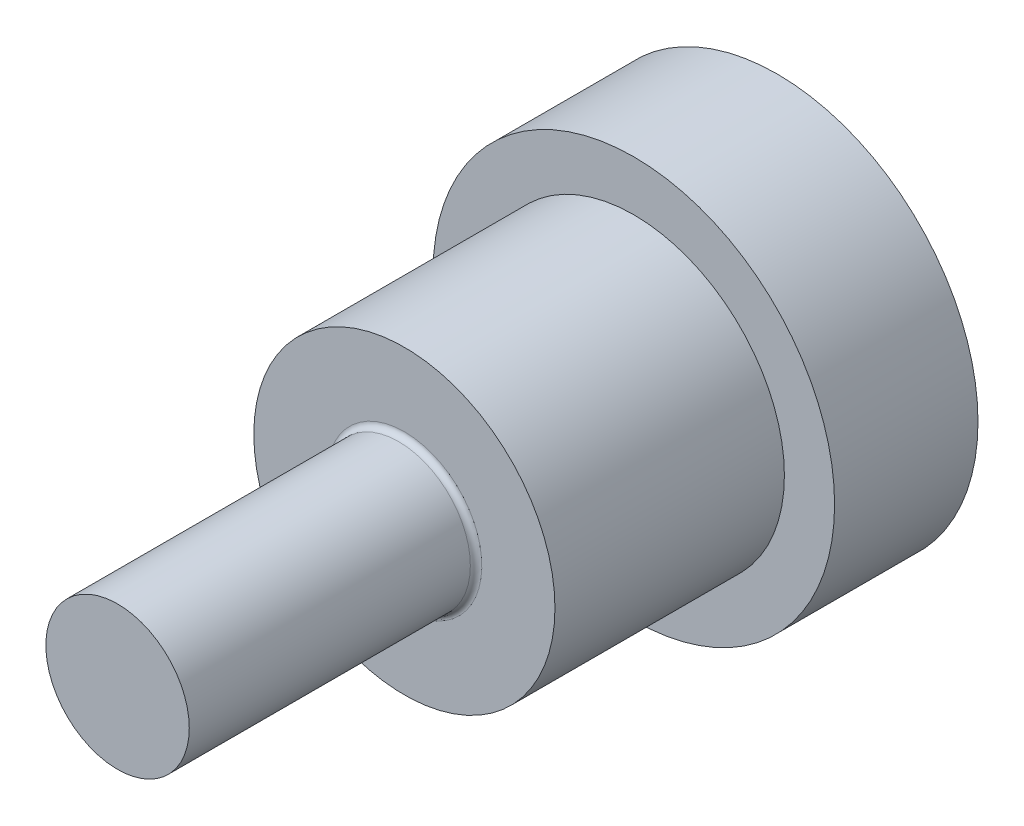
ISO-10303-21;
HEADER;
FILE_DESCRIPTION(('STEP AP214'),'2;1');
FILE_NAME('part.step','',(''),(''),'','','');
FILE_SCHEMA(('AUTOMOTIVE_DESIGN { 1 0 10303 214 1 1 1 1 }'));
ENDSEC;
DATA;
#1=APPLICATION_CONTEXT('core data for automotive mechanical design processes');
#2=APPLICATION_PROTOCOL_DEFINITION('international standard','automotive_design',2000,#1);
#3=PRODUCT_CONTEXT('',#1,'mechanical');
#4=PRODUCT('Part','Part','',(#3));
#5=PRODUCT_RELATED_PRODUCT_CATEGORY('part','',(#4));
#6=PRODUCT_DEFINITION_FORMATION('','',#4);
#7=PRODUCT_DEFINITION_CONTEXT('part definition',#1,'design');
#8=PRODUCT_DEFINITION('design','',#6,#7);
#9=PRODUCT_DEFINITION_SHAPE('','',#8);
#10=(LENGTH_UNIT() NAMED_UNIT(*) SI_UNIT(.MILLI.,.METRE.));
#11=(NAMED_UNIT(*) PLANE_ANGLE_UNIT() SI_UNIT($,.RADIAN.));
#12=(NAMED_UNIT(*) SI_UNIT($,.STERADIAN.) SOLID_ANGLE_UNIT());
#13=UNCERTAINTY_MEASURE_WITH_UNIT(LENGTH_MEASURE(1.E-05),#10,'distance_accuracy_value','');
#14=(GEOMETRIC_REPRESENTATION_CONTEXT(3) GLOBAL_UNCERTAINTY_ASSIGNED_CONTEXT((#13)) GLOBAL_UNIT_ASSIGNED_CONTEXT((#10,
#11,#12)) REPRESENTATION_CONTEXT('',''));
#15=CARTESIAN_POINT('',(0.,0.,0.));
#16=DIRECTION('',(0.,0.,1.));
#17=DIRECTION('',(1.,0.,0.));
#18=AXIS2_PLACEMENT_3D('',#15,#16,#17);
#19=CARTESIAN_POINT('',(0.,0.,-1.));
#20=DIRECTION('',(0.,0.,-1.));
#21=DIRECTION('',(0.,-1.,0.));
#22=AXIS2_PLACEMENT_3D('',#19,#20,#21);
#23=PLANE('',#22);
#24=CARTESIAN_POINT('',(0.,0.,-1.));
#25=DIRECTION('',(0.,0.,-1.));
#26=DIRECTION('',(0.,1.,0.));
#27=AXIS2_PLACEMENT_3D('',#24,#25,#26);
#28=CIRCLE('',#27,5.25);
#29=CARTESIAN_POINT('',(0.,5.25,-1.00000000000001));
#30=VERTEX_POINT('',#29);
#31=EDGE_CURVE('E9',#30,#30,#28,.F.);
#32=ORIENTED_EDGE('',*,*,#31,.F.);
#33=EDGE_LOOP('',(#32));
#34=FACE_BOUND('',#33,.T.);
#35=CARTESIAN_POINT('',(0.,0.,-1.));
#36=DIRECTION('',(0.,0.,-1.));
#37=DIRECTION('',(0.,1.,0.));
#38=AXIS2_PLACEMENT_3D('',#35,#36,#37);
#39=CIRCLE('',#38,7.);
#40=CARTESIAN_POINT('',(0.,7.,-1.00000000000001));
#41=VERTEX_POINT('',#40);
#42=EDGE_CURVE('E89',#41,#41,#39,.T.);
#43=ORIENTED_EDGE('',*,*,#42,.F.);
#44=EDGE_LOOP('',(#43));
#45=FACE_BOUND('',#44,.T.);
#46=ADVANCED_FACE('F14',(#34,#45),#23,.F.);
#47=CARTESIAN_POINT('',(0.,0.,-6.));
#48=DIRECTION('',(0.,0.,1.));
#49=DIRECTION('',(0.,1.,0.));
#50=AXIS2_PLACEMENT_3D('',#47,#48,#49);
#51=CYLINDRICAL_SURFACE('',#50,7.);
#52=CARTESIAN_POINT('',(0.,0.,-6.));
#53=DIRECTION('',(0.,0.,-1.));
#54=DIRECTION('',(0.,1.,0.));
#55=AXIS2_PLACEMENT_3D('',#52,#53,#54);
#56=CIRCLE('',#55,7.);
#57=CARTESIAN_POINT('',(0.,6.99999999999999,-6.00000000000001));
#58=VERTEX_POINT('',#57);
#59=EDGE_CURVE('E348',#58,#58,#56,.T.);
#60=ORIENTED_EDGE('',*,*,#59,.F.);
#61=EDGE_LOOP('',(#60));
#62=FACE_BOUND('',#61,.T.);
#63=ORIENTED_EDGE('',*,*,#42,.T.);
#64=EDGE_LOOP('',(#63));
#65=FACE_BOUND('',#64,.T.);
#66=ADVANCED_FACE('F148',(#62,#65),#51,.T.);
#67=CARTESIAN_POINT('',(0.,0.,-6.));
#68=DIRECTION('',(0.,0.,-1.));
#69=DIRECTION('',(0.,-1.,0.));
#70=AXIS2_PLACEMENT_3D('',#67,#68,#69);
#71=PLANE('',#70);
#72=ORIENTED_EDGE('',*,*,#59,.T.);
#73=EDGE_LOOP('',(#72));
#74=FACE_BOUND('',#73,.T.);
#75=CARTESIAN_POINT('',(0.,0.,-6.));
#76=DIRECTION('',(0.,0.,-1.));
#77=DIRECTION('',(0.,1.,0.));
#78=AXIS2_PLACEMENT_3D('',#75,#76,#77);
#79=CIRCLE('',#78,3.);
#80=CARTESIAN_POINT('',(0.,2.99999999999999,-6.00000000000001));
#81=VERTEX_POINT('',#80);
#82=EDGE_CURVE('E350',#81,#81,#79,.T.);
#83=ORIENTED_EDGE('',*,*,#82,.F.);
#84=EDGE_LOOP('',(#83));
#85=FACE_BOUND('',#84,.T.);
#86=ADVANCED_FACE('F154',(#74,#85),#71,.T.);
#87=CARTESIAN_POINT('',(0.,0.,17.));
#88=DIRECTION('',(0.,0.,1.));
#89=DIRECTION('',(0.,-1.,0.));
#90=AXIS2_PLACEMENT_3D('',#87,#88,#89);
#91=CYLINDRICAL_SURFACE('',#90,5.25);
#92=ORIENTED_EDGE('',*,*,#31,.T.);
#93=EDGE_LOOP('',(#92));
#94=FACE_BOUND('',#93,.T.);
#95=CARTESIAN_POINT('',(0.,0.,7.));
#96=DIRECTION('',(0.,0.,1.));
#97=DIRECTION('',(1.,0.,0.));
#98=AXIS2_PLACEMENT_3D('',#95,#96,#97);
#99=CIRCLE('',#98,5.25);
#100=CARTESIAN_POINT('',(5.25,0.,7.));
#101=VERTEX_POINT('',#100);
#102=EDGE_CURVE('E351',#101,#101,#99,.T.);
#103=ORIENTED_EDGE('',*,*,#102,.F.);
#104=EDGE_LOOP('',(#103));
#105=FACE_BOUND('',#104,.T.);
#106=ADVANCED_FACE('F160',(#94,#105),#91,.T.);
#107=CARTESIAN_POINT('',(0.,0.,17.));
#108=DIRECTION('',(0.,0.,-1.));
#109=DIRECTION('',(0.,1.,0.));
#110=AXIS2_PLACEMENT_3D('',#107,#108,#109);
#111=PLANE('',#110);
#112=CARTESIAN_POINT('',(0.,0.,17.));
#113=DIRECTION('',(0.,0.,1.));
#114=DIRECTION('',(1.,0.,0.));
#115=AXIS2_PLACEMENT_3D('',#112,#113,#114);
#116=CIRCLE('',#115,2.5);
#117=CARTESIAN_POINT('',(2.5,0.,17.));
#118=VERTEX_POINT('',#117);
#119=EDGE_CURVE('E86',#118,#118,#116,.T.);
#120=ORIENTED_EDGE('',*,*,#119,.T.);
#121=EDGE_LOOP('',(#120));
#122=FACE_BOUND('',#121,.T.);
#123=ADVANCED_FACE('F163',(#122),#111,.F.);
#124=CARTESIAN_POINT('',(0.,0.,17.));
#125=DIRECTION('',(0.,0.,1.));
#126=DIRECTION('',(0.,-1.,0.));
#127=AXIS2_PLACEMENT_3D('',#124,#125,#126);
#128=CYLINDRICAL_SURFACE('',#127,2.5);
#129=CARTESIAN_POINT('',(0.,0.,7.2));
#130=DIRECTION('',(0.,0.,-1.));
#131=DIRECTION('',(0.,1.,0.));
#132=AXIS2_PLACEMENT_3D('',#129,#130,#131);
#133=CIRCLE('',#132,2.5);
#134=CARTESIAN_POINT('',(0.,2.5,7.2));
#135=VERTEX_POINT('',#134);
#136=EDGE_CURVE('E118',#135,#135,#133,.F.);
#137=ORIENTED_EDGE('',*,*,#136,.T.);
#138=EDGE_LOOP('',(#137));
#139=FACE_BOUND('',#138,.T.);
#140=ORIENTED_EDGE('',*,*,#119,.F.);
#141=EDGE_LOOP('',(#140));
#142=FACE_BOUND('',#141,.T.);
#143=ADVANCED_FACE('F170',(#139,#142),#128,.T.);
#144=CARTESIAN_POINT('',(0.,0.,7.2));
#145=DIRECTION('',(0.,0.,-1.));
#146=DIRECTION('',(0.,1.,0.));
#147=AXIS2_PLACEMENT_3D('',#144,#145,#146);
#148=TOROIDAL_SURFACE('',#147,2.7,0.2);
#149=CARTESIAN_POINT('',(0.,0.,7.));
#150=DIRECTION('',(0.,0.,-1.));
#151=DIRECTION('',(0.,1.,0.));
#152=AXIS2_PLACEMENT_3D('',#149,#150,#151);
#153=CIRCLE('',#152,2.7);
#154=CARTESIAN_POINT('',(0.,2.7,7.));
#155=VERTEX_POINT('',#154);
#156=EDGE_CURVE('E122',#155,#155,#153,.T.);
#157=ORIENTED_EDGE('',*,*,#156,.F.);
#158=EDGE_LOOP('',(#157));
#159=FACE_BOUND('',#158,.T.);
#160=ORIENTED_EDGE('',*,*,#136,.F.);
#161=EDGE_LOOP('',(#160));
#162=FACE_BOUND('',#161,.T.);
#163=ADVANCED_FACE('F16',(#159,#162),#148,.F.);
#164=CARTESIAN_POINT('',(2.5,0.,7.));
#165=DIRECTION('',(0.,0.,-1.));
#166=DIRECTION('',(0.,1.,0.));
#167=AXIS2_PLACEMENT_3D('',#164,#165,#166);
#168=PLANE('',#167);
#169=ORIENTED_EDGE('',*,*,#156,.T.);
#170=EDGE_LOOP('',(#169));
#171=FACE_BOUND('',#170,.T.);
#172=ORIENTED_EDGE('',*,*,#102,.T.);
#173=EDGE_LOOP('',(#172));
#174=FACE_BOUND('',#173,.T.);
#175=ADVANCED_FACE('F165',(#171,#174),#168,.F.);
#176=CARTESIAN_POINT('',(1.25,-0.721687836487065,-3.5));
#177=DIRECTION('',(0.,0.,-1.));
#178=DIRECTION('',(1.,0.,0.));
#179=AXIS2_PLACEMENT_3D('',#176,#177,#178);
#180=PLANE('',#179);
#181=DIRECTION('',(0.866025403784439,0.5,0.));
#182=VECTOR('',#181,1.);
#183=CARTESIAN_POINT('',(0.,-1.44337567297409,-3.5));
#184=LINE('',#183,#182);
#185=CARTESIAN_POINT('',(0.,-1.44337567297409,-3.5));
#186=VERTEX_POINT('',#185);
#187=CARTESIAN_POINT('',(1.25,-0.721687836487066,-3.5));
#188=VERTEX_POINT('',#187);
#189=EDGE_CURVE('E66',#186,#188,#184,.T.);
#190=ORIENTED_EDGE('',*,*,#189,.F.);
#191=DIRECTION('',(-0.86602540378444,0.5,0.));
#192=VECTOR('',#191,1.);
#193=CARTESIAN_POINT('',(0.,-1.44337567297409,-3.5));
#194=LINE('',#193,#192);
#195=CARTESIAN_POINT('',(-1.25,-0.721687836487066,-3.5));
#196=VERTEX_POINT('',#195);
#197=EDGE_CURVE('E93',#186,#196,#194,.T.);
#198=ORIENTED_EDGE('',*,*,#197,.T.);
#199=DIRECTION('',(0.,1.,0.));
#200=VECTOR('',#199,1.);
#201=CARTESIAN_POINT('',(-1.25,-0.721687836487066,-3.5));
#202=LINE('',#201,#200);
#203=CARTESIAN_POINT('',(-1.25,0.721687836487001,-3.5));
#204=VERTEX_POINT('',#203);
#205=EDGE_CURVE('E96',#196,#204,#202,.T.);
#206=ORIENTED_EDGE('',*,*,#205,.T.);
#207=DIRECTION('',(-0.86602540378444,-0.5,0.));
#208=VECTOR('',#207,1.);
#209=CARTESIAN_POINT('',(0.,1.44337567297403,-3.5));
#210=LINE('',#209,#208);
#211=CARTESIAN_POINT('',(0.,1.44337567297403,-3.5));
#212=VERTEX_POINT('',#211);
#213=EDGE_CURVE('E99',#212,#204,#210,.T.);
#214=ORIENTED_EDGE('',*,*,#213,.F.);
#215=DIRECTION('',(0.86602540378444,-0.5,0.));
#216=VECTOR('',#215,1.);
#217=CARTESIAN_POINT('',(0.,1.44337567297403,-3.5));
#218=LINE('',#217,#216);
#219=CARTESIAN_POINT('',(1.25,0.721687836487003,-3.5));
#220=VERTEX_POINT('',#219);
#221=EDGE_CURVE('E102',#212,#220,#218,.T.);
#222=ORIENTED_EDGE('',*,*,#221,.T.);
#223=DIRECTION('',(0.,-1.,0.));
#224=VECTOR('',#223,1.);
#225=CARTESIAN_POINT('',(1.25,0.721687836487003,-3.5));
#226=LINE('',#225,#224);
#227=EDGE_CURVE('E105',#220,#188,#226,.T.);
#228=ORIENTED_EDGE('',*,*,#227,.T.);
#229=EDGE_LOOP('',(#190,#198,#206,#214,#222,#228));
#230=FACE_BOUND('',#229,.T.);
#231=ADVANCED_FACE('F168',(#230),#180,.T.);
#232=CARTESIAN_POINT('',(-1.25,-0.721687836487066,-3.5));
#233=DIRECTION('',(-1.,0.,0.));
#234=DIRECTION('',(0.,1.,0.));
#235=AXIS2_PLACEMENT_3D('',#232,#233,#234);
#236=PLANE('',#235);
#237=DIRECTION('',(0.,0.,-1.));
#238=VECTOR('',#237,1.);
#239=CARTESIAN_POINT('',(-1.25,-0.721687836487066,-3.5));
#240=LINE('',#239,#238);
#241=CARTESIAN_POINT('',(-1.25,-0.721687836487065,-5.));
#242=VERTEX_POINT('',#241);
#243=EDGE_CURVE('E109',#196,#242,#240,.T.);
#244=ORIENTED_EDGE('',*,*,#243,.T.);
#245=DIRECTION('',(0.,1.,0.));
#246=VECTOR('',#245,1.);
#247=CARTESIAN_POINT('',(-1.25,-0.721687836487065,-5.));
#248=LINE('',#247,#246);
#249=CARTESIAN_POINT('',(-1.25,0.721687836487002,-5.));
#250=VERTEX_POINT('',#249);
#251=EDGE_CURVE('E360',#242,#250,#248,.T.);
#252=ORIENTED_EDGE('',*,*,#251,.T.);
#253=DIRECTION('',(0.,0.,-1.));
#254=VECTOR('',#253,1.);
#255=CARTESIAN_POINT('',(-1.25,0.721687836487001,-3.5));
#256=LINE('',#255,#254);
#257=EDGE_CURVE('E111',#204,#250,#256,.T.);
#258=ORIENTED_EDGE('',*,*,#257,.F.);
#259=ORIENTED_EDGE('',*,*,#205,.F.);
#260=EDGE_LOOP('',(#244,#252,#258,#259));
#261=FACE_BOUND('',#260,.T.);
#262=ADVANCED_FACE('F208',(#261),#236,.F.);
#263=CARTESIAN_POINT('',(0.,1.44337567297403,-3.5));
#264=DIRECTION('',(0.5,-0.86602540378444,0.));
#265=DIRECTION('',(-0.86602540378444,-0.5,0.));
#266=AXIS2_PLACEMENT_3D('',#263,#264,#265);
#267=PLANE('',#266);
#268=ORIENTED_EDGE('',*,*,#257,.T.);
#269=DIRECTION('',(-0.86602540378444,-0.5,0.));
#270=VECTOR('',#269,1.);
#271=CARTESIAN_POINT('',(0.,1.44337567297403,-5.));
#272=LINE('',#271,#270);
#273=CARTESIAN_POINT('',(0.,1.44337567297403,-5.));
#274=VERTEX_POINT('',#273);
#275=EDGE_CURVE('E363',#274,#250,#272,.T.);
#276=ORIENTED_EDGE('',*,*,#275,.F.);
#277=DIRECTION('',(0.,0.,-1.));
#278=VECTOR('',#277,1.);
#279=CARTESIAN_POINT('',(0.,1.44337567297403,-3.5));
#280=LINE('',#279,#278);
#281=EDGE_CURVE('E113',#212,#274,#280,.T.);
#282=ORIENTED_EDGE('',*,*,#281,.F.);
#283=ORIENTED_EDGE('',*,*,#213,.T.);
#284=EDGE_LOOP('',(#268,#276,#282,#283));
#285=FACE_BOUND('',#284,.T.);
#286=ADVANCED_FACE('F217',(#285),#267,.T.);
#287=CARTESIAN_POINT('',(0.,1.44337567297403,-3.5));
#288=DIRECTION('',(0.5,0.86602540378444,0.));
#289=DIRECTION('',(0.86602540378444,-0.5,0.));
#290=AXIS2_PLACEMENT_3D('',#287,#288,#289);
#291=PLANE('',#290);
#292=ORIENTED_EDGE('',*,*,#281,.T.);
#293=DIRECTION('',(0.86602540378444,-0.5,0.));
#294=VECTOR('',#293,1.);
#295=CARTESIAN_POINT('',(0.,1.44337567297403,-5.));
#296=LINE('',#295,#294);
#297=CARTESIAN_POINT('',(1.25,0.721687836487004,-5.));
#298=VERTEX_POINT('',#297);
#299=EDGE_CURVE('E79',#274,#298,#296,.T.);
#300=ORIENTED_EDGE('',*,*,#299,.T.);
#301=DIRECTION('',(0.,0.,-1.));
#302=VECTOR('',#301,1.);
#303=CARTESIAN_POINT('',(1.25,0.721687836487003,-3.5));
#304=LINE('',#303,#302);
#305=EDGE_CURVE('E71',#220,#298,#304,.T.);
#306=ORIENTED_EDGE('',*,*,#305,.F.);
#307=ORIENTED_EDGE('',*,*,#221,.F.);
#308=EDGE_LOOP('',(#292,#300,#306,#307));
#309=FACE_BOUND('',#308,.T.);
#310=ADVANCED_FACE('F226',(#309),#291,.F.);
#311=CARTESIAN_POINT('',(1.25,0.721687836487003,-3.5));
#312=DIRECTION('',(1.,0.,0.));
#313=DIRECTION('',(0.,-1.,0.));
#314=AXIS2_PLACEMENT_3D('',#311,#312,#313);
#315=PLANE('',#314);
#316=ORIENTED_EDGE('',*,*,#305,.T.);
#317=DIRECTION('',(0.,-1.,0.));
#318=VECTOR('',#317,1.);
#319=CARTESIAN_POINT('',(1.25,0.721687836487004,-5.));
#320=LINE('',#319,#318);
#321=CARTESIAN_POINT('',(1.25,-0.721687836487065,-5.));
#322=VERTEX_POINT('',#321);
#323=EDGE_CURVE('E74',#298,#322,#320,.T.);
#324=ORIENTED_EDGE('',*,*,#323,.T.);
#325=DIRECTION('',(0.,0.,-1.));
#326=VECTOR('',#325,1.);
#327=CARTESIAN_POINT('',(1.25,-0.721687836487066,-3.5));
#328=LINE('',#327,#326);
#329=EDGE_CURVE('E63',#188,#322,#328,.T.);
#330=ORIENTED_EDGE('',*,*,#329,.F.);
#331=ORIENTED_EDGE('',*,*,#227,.F.);
#332=EDGE_LOOP('',(#316,#324,#330,#331));
#333=FACE_BOUND('',#332,.T.);
#334=ADVANCED_FACE('F75',(#333),#315,.F.);
#335=CARTESIAN_POINT('',(0.,-1.44337567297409,-3.5));
#336=DIRECTION('',(-0.5,0.86602540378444,0.));
#337=DIRECTION('',(0.86602540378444,0.5,0.));
#338=AXIS2_PLACEMENT_3D('',#335,#336,#337);
#339=PLANE('',#338);
#340=ORIENTED_EDGE('',*,*,#329,.T.);
#341=DIRECTION('',(0.866025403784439,0.5,0.));
#342=VECTOR('',#341,1.);
#343=CARTESIAN_POINT('',(0.,-1.44337567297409,-5.));
#344=LINE('',#343,#342);
#345=CARTESIAN_POINT('',(0.,-1.44337567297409,-5.));
#346=VERTEX_POINT('',#345);
#347=EDGE_CURVE('E29',#346,#322,#344,.T.);
#348=ORIENTED_EDGE('',*,*,#347,.F.);
#349=DIRECTION('',(0.,0.,-1.));
#350=VECTOR('',#349,1.);
#351=CARTESIAN_POINT('',(0.,-1.44337567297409,-3.5));
#352=LINE('',#351,#350);
#353=EDGE_CURVE('E33',#186,#346,#352,.T.);
#354=ORIENTED_EDGE('',*,*,#353,.F.);
#355=ORIENTED_EDGE('',*,*,#189,.T.);
#356=EDGE_LOOP('',(#340,#348,#354,#355));
#357=FACE_BOUND('',#356,.T.);
#358=ADVANCED_FACE('F65',(#357),#339,.T.);
#359=CARTESIAN_POINT('',(0.,-1.44337567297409,-3.5));
#360=DIRECTION('',(-0.5,-0.86602540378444,0.));
#361=DIRECTION('',(-0.86602540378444,0.5,0.));
#362=AXIS2_PLACEMENT_3D('',#359,#360,#361);
#363=PLANE('',#362);
#364=ORIENTED_EDGE('',*,*,#197,.F.);
#365=ORIENTED_EDGE('',*,*,#353,.T.);
#366=DIRECTION('',(-0.86602540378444,0.5,0.));
#367=VECTOR('',#366,1.);
#368=CARTESIAN_POINT('',(0.,-1.44337567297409,-5.));
#369=LINE('',#368,#367);
#370=EDGE_CURVE('E85',#346,#242,#369,.T.);
#371=ORIENTED_EDGE('',*,*,#370,.T.);
#372=ORIENTED_EDGE('',*,*,#243,.F.);
#373=EDGE_LOOP('',(#364,#365,#371,#372));
#374=FACE_BOUND('',#373,.T.);
#375=ADVANCED_FACE('F250',(#374),#363,.F.);
#376=CARTESIAN_POINT('',(0.,0.,-5.));
#377=DIRECTION('',(0.,0.,-1.));
#378=DIRECTION('',(1.,0.,0.));
#379=AXIS2_PLACEMENT_3D('',#376,#377,#378);
#380=PLANE('',#379);
#381=CARTESIAN_POINT('',(0.,0.,-5.));
#382=DIRECTION('',(0.,0.,-1.));
#383=DIRECTION('',(1.,0.,0.));
#384=AXIS2_PLACEMENT_3D('',#381,#382,#383);
#385=CIRCLE('',#384,2.75);
#386=CARTESIAN_POINT('',(2.75000000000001,0.,-5.));
#387=VERTEX_POINT('',#386);
#388=EDGE_CURVE('E70',#387,#387,#385,.T.);
#389=ORIENTED_EDGE('',*,*,#388,.T.);
#390=EDGE_LOOP('',(#389));
#391=FACE_BOUND('',#390,.T.);
#392=ORIENTED_EDGE('',*,*,#370,.F.);
#393=ORIENTED_EDGE('',*,*,#347,.T.);
#394=ORIENTED_EDGE('',*,*,#323,.F.);
#395=ORIENTED_EDGE('',*,*,#299,.F.);
#396=ORIENTED_EDGE('',*,*,#275,.T.);
#397=ORIENTED_EDGE('',*,*,#251,.F.);
#398=EDGE_LOOP('',(#392,#393,#394,#395,#396,#397));
#399=FACE_BOUND('',#398,.T.);
#400=ADVANCED_FACE('F82',(#391,#399),#380,.T.);
#401=CARTESIAN_POINT('',(0.,0.,-17.));
#402=DIRECTION('',(0.,0.,-1.));
#403=DIRECTION('',(1.,0.,0.));
#404=AXIS2_PLACEMENT_3D('',#401,#402,#403);
#405=CYLINDRICAL_SURFACE('',#404,2.75);
#406=CARTESIAN_POINT('',(0.,0.,-2.));
#407=DIRECTION('',(0.,0.,-1.));
#408=DIRECTION('',(0.,1.,0.));
#409=AXIS2_PLACEMENT_3D('',#406,#407,#408);
#410=CIRCLE('',#409,2.75);
#411=CARTESIAN_POINT('',(0.,2.74999999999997,-2.));
#412=VERTEX_POINT('',#411);
#413=EDGE_CURVE('E22',#412,#412,#410,.T.);
#414=ORIENTED_EDGE('',*,*,#413,.T.);
#415=EDGE_LOOP('',(#414));
#416=FACE_BOUND('',#415,.T.);
#417=ORIENTED_EDGE('',*,*,#388,.F.);
#418=EDGE_LOOP('',(#417));
#419=FACE_BOUND('',#418,.T.);
#420=ADVANCED_FACE('F129',(#416,#419),#405,.T.);
#421=CARTESIAN_POINT('',(0.,0.,-2.));
#422=DIRECTION('',(0.,0.,-1.));
#423=DIRECTION('',(0.,-1.,0.));
#424=AXIS2_PLACEMENT_3D('',#421,#422,#423);
#425=PLANE('',#424);
#426=ORIENTED_EDGE('',*,*,#413,.F.);
#427=EDGE_LOOP('',(#426));
#428=FACE_BOUND('',#427,.T.);
#429=CARTESIAN_POINT('',(0.,0.,-2.));
#430=DIRECTION('',(0.,0.,-1.));
#431=DIRECTION('',(0.,-1.,0.));
#432=AXIS2_PLACEMENT_3D('',#429,#430,#431);
#433=CIRCLE('',#432,3.);
#434=CARTESIAN_POINT('',(0.,-3.,-2.));
#435=VERTEX_POINT('',#434);
#436=EDGE_CURVE('E119',#435,#435,#433,.T.);
#437=ORIENTED_EDGE('',*,*,#436,.T.);
#438=EDGE_LOOP('',(#437));
#439=FACE_BOUND('',#438,.T.);
#440=ADVANCED_FACE('F132',(#428,#439),#425,.T.);
#441=CARTESIAN_POINT('',(0.,0.,-2.));
#442=DIRECTION('',(0.,0.,-1.));
#443=DIRECTION('',(0.,-1.,0.));
#444=AXIS2_PLACEMENT_3D('',#441,#442,#443);
#445=CYLINDRICAL_SURFACE('',#444,3.);
#446=ORIENTED_EDGE('',*,*,#82,.T.);
#447=EDGE_LOOP('',(#446));
#448=FACE_BOUND('',#447,.T.);
#449=ORIENTED_EDGE('',*,*,#436,.F.);
#450=EDGE_LOOP('',(#449));
#451=FACE_BOUND('',#450,.T.);
#452=ADVANCED_FACE('F135',(#448,#451),#445,.F.);
#453=CLOSED_SHELL('',(#46,#66,#86,#106,#123,#143,#163,#175,#231,#262,#286,#310,#334,#358,#375,
#400,#420,#440,#452));
#454=MANIFOLD_SOLID_BREP('B1',#453);
#455=ADVANCED_BREP_SHAPE_REPRESENTATION('',(#18,#454),#14);
#456=SHAPE_DEFINITION_REPRESENTATION(#9,#455);
ENDSEC;
END-ISO-10303-21;
